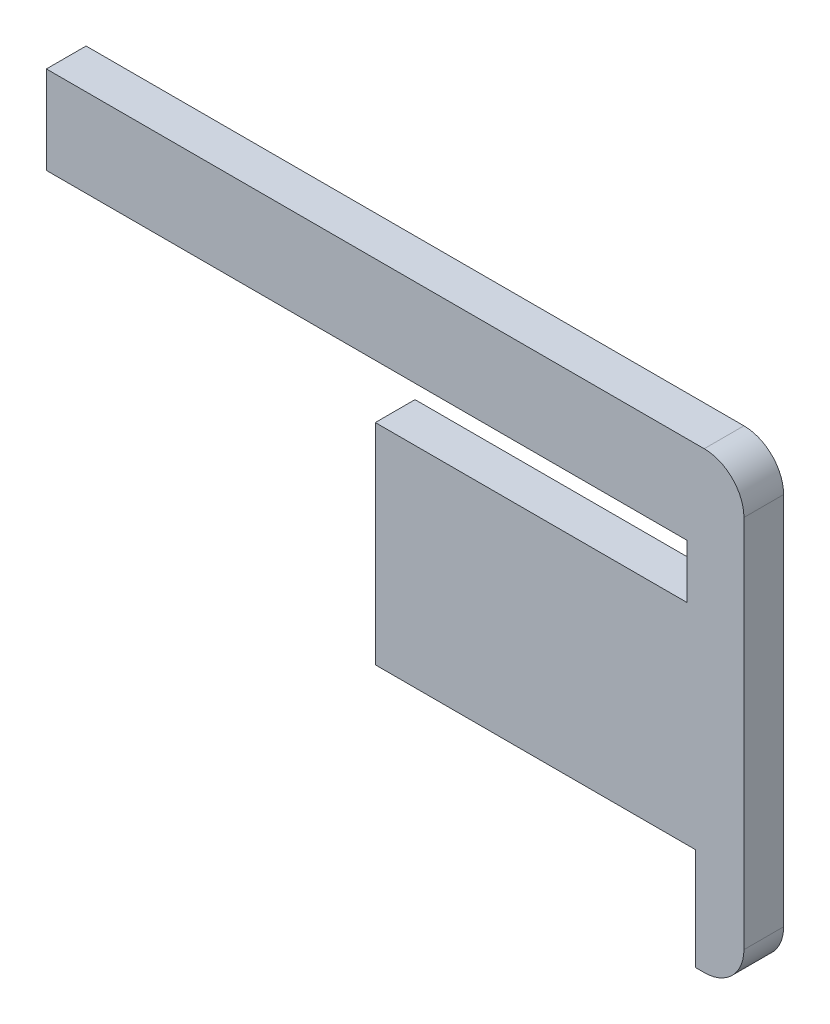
from build123d import *

# Parameters (mm, degrees)
SKETCH1_W           = 10
SKETCH1_H           = 16
BOSS_EXTRUDE1_DEPTH = 1.4
FILLET1_R           = 1.4
SKETCH2_W           = 8
SKETCH2_H           = 1.9
SKETCH2_W_2         = 8.3
SKETCH2_H_2         = 3.6
CUT_EXTRUDE1_DEPTH  = 1.4
SKETCH3_W           = 14.6
SKETCH3_H           = 3.1
SKETCH3_W_2         = 3
SKETCH3_H_2         = 7.4
BOSS_EXTRUDE2_DEPTH = 1.4


with BuildPart() as part:
    # Sketch1 → Boss-Extrude1 (new body)
    with BuildSketch(Plane.XY):
        with Locations((-5, 8)):
            Rectangle(SKETCH1_W, SKETCH1_H)
    extrude(amount=BOSS_EXTRUDE1_DEPTH)

    # Fillet1
    fillet1_edges = [part.edges().sort_by_distance(p)[0] for p in [
        (0, 16, 0.7),
        (0, 0, 0.7),
    ]]
    fillet(fillet1_edges, radius=FILLET1_R)

    # Sketch2 → Cut-Extrude1 (cut)
    with BuildSketch(Plane.XY):
        with Locations((-6, 11.95)):
            Rectangle(SKETCH2_W, SKETCH2_H)
        with Locations((-5.85, 1.8)):
            Rectangle(SKETCH2_W_2, SKETCH2_H_2)
    extrude(amount=CUT_EXTRUDE1_DEPTH, mode=Mode.SUBTRACT)

    # Sketch3 → Boss-Extrude2 (add)
    with BuildSketch(Plane.XY):
        with Locations((-17.3, 14.45)):
            Rectangle(SKETCH3_W, SKETCH3_H)
        with Locations((-11.5, 7.3)):
            Rectangle(SKETCH3_W_2, SKETCH3_H_2)
    extrude(amount=BOSS_EXTRUDE2_DEPTH)


solid = part.part
